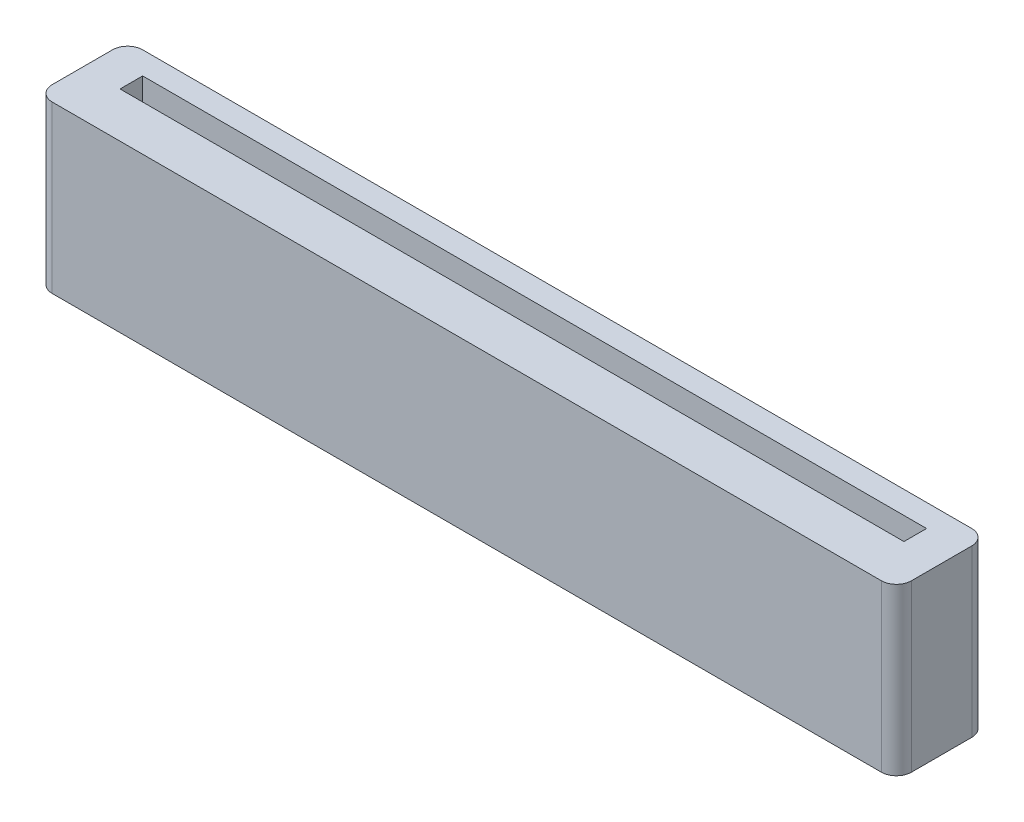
from build123d import *

# Parameters (mm, degrees)
BOSS_EXTRU_1_DEPTH      = 11
ESQUISSE2_W             = 52
ESQUISSE2_H             = 1.5
ENL_V_MAT_EXTRU_1_DEPTH = 6


with BuildPart() as part:
    # Esquisse1 → Boss.-Extru.1 (new body)
    with BuildSketch(Plane(origin=(0, 0, 0), x_dir=(1, 0, 0), z_dir=(0, 1, 0))):
        with BuildLine():
            Line((-27.5, 3), (27.5, 3))
            ThreePointArc((27.5, 3), (28.207106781, 2.707106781), (28.5, 2))
            Line((28.5, 2), (28.5, -2))
            ThreePointArc((28.5, -2), (28.207106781, -2.707106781), (27.5, -3))
            Line((27.5, -3), (-27.5, -3))
            ThreePointArc((-27.5, -3), (-28.207106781, -2.707106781), (-28.5, -2))
            Line((-28.5, -2), (-28.5, 2))
            ThreePointArc((-28.5, 2), (-28.207106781, 2.707106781), (-27.5, 3))
        make_face()
    extrude(amount=BOSS_EXTRU_1_DEPTH)

    # Esquisse2 → Enl_v. mat.-Extru.1 (cut)
    with BuildSketch(Plane(origin=(0, 11, 0), x_dir=(1, 0, 0), z_dir=(0, 1, 0))):
        with Locations((0, 0.75)):
            Rectangle(ESQUISSE2_W, ESQUISSE2_H)
    extrude(amount=-ENL_V_MAT_EXTRU_1_DEPTH, mode=Mode.SUBTRACT)


solid = part.part
